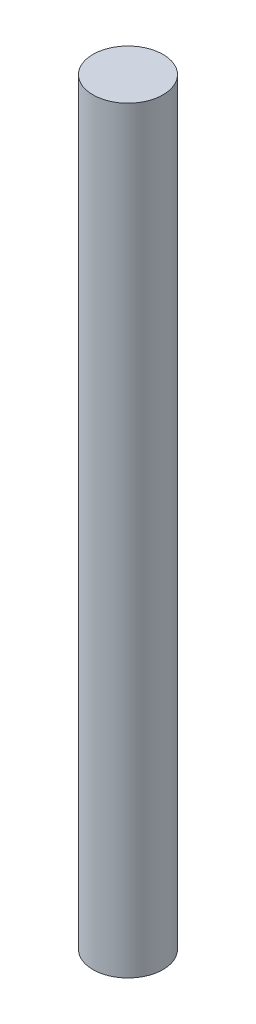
ISO-10303-21;
HEADER;
FILE_DESCRIPTION(('STEP AP214'),'2;1');
FILE_NAME('part.step','',(''),(''),'','','');
FILE_SCHEMA(('AUTOMOTIVE_DESIGN { 1 0 10303 214 1 1 1 1 }'));
ENDSEC;
DATA;
#1=APPLICATION_CONTEXT('core data for automotive mechanical design processes');
#2=APPLICATION_PROTOCOL_DEFINITION('international standard','automotive_design',2000,#1);
#3=PRODUCT_CONTEXT('',#1,'mechanical');
#4=PRODUCT('Part','Part','',(#3));
#5=PRODUCT_RELATED_PRODUCT_CATEGORY('part','',(#4));
#6=PRODUCT_DEFINITION_FORMATION('','',#4);
#7=PRODUCT_DEFINITION_CONTEXT('part definition',#1,'design');
#8=PRODUCT_DEFINITION('design','',#6,#7);
#9=PRODUCT_DEFINITION_SHAPE('','',#8);
#10=(LENGTH_UNIT() NAMED_UNIT(*) SI_UNIT(.MILLI.,.METRE.));
#11=(NAMED_UNIT(*) PLANE_ANGLE_UNIT() SI_UNIT($,.RADIAN.));
#12=(NAMED_UNIT(*) SI_UNIT($,.STERADIAN.) SOLID_ANGLE_UNIT());
#13=UNCERTAINTY_MEASURE_WITH_UNIT(LENGTH_MEASURE(1.E-05),#10,'distance_accuracy_value','');
#14=(GEOMETRIC_REPRESENTATION_CONTEXT(3) GLOBAL_UNCERTAINTY_ASSIGNED_CONTEXT((#13)) GLOBAL_UNIT_ASSIGNED_CONTEXT((#10,
#11,#12)) REPRESENTATION_CONTEXT('',''));
#15=CARTESIAN_POINT('',(0.,0.,0.));
#16=DIRECTION('',(0.,0.,1.));
#17=DIRECTION('',(1.,0.,0.));
#18=AXIS2_PLACEMENT_3D('',#15,#16,#17);
#19=CARTESIAN_POINT('',(0.,120.142,0.));
#20=DIRECTION('',(0.,-1.,0.));
#21=DIRECTION('',(0.,0.,-1.));
#22=AXIS2_PLACEMENT_3D('',#19,#20,#21);
#23=CYLINDRICAL_SURFACE('',#22,5.55625);
#24=CARTESIAN_POINT('',(0.,120.142,0.));
#25=DIRECTION('',(0.,1.,0.));
#26=DIRECTION('',(0.,0.,1.));
#27=AXIS2_PLACEMENT_3D('',#24,#25,#26);
#28=CIRCLE('',#27,5.55625);
#29=CARTESIAN_POINT('',(0.,120.142,5.55625));
#30=VERTEX_POINT('',#29);
#31=EDGE_CURVE('E10',#30,#30,#28,.T.);
#32=ORIENTED_EDGE('',*,*,#31,.F.);
#33=EDGE_LOOP('',(#32));
#34=FACE_BOUND('',#33,.T.);
#35=CARTESIAN_POINT('',(0.,0.,0.));
#36=DIRECTION('',(0.,1.,0.));
#37=DIRECTION('',(0.,0.,1.));
#38=AXIS2_PLACEMENT_3D('',#35,#36,#37);
#39=CIRCLE('',#38,5.55625);
#40=CARTESIAN_POINT('',(0.,0.,5.55625));
#41=VERTEX_POINT('',#40);
#42=EDGE_CURVE('E33',#41,#41,#39,.T.);
#43=ORIENTED_EDGE('',*,*,#42,.T.);
#44=EDGE_LOOP('',(#43));
#45=FACE_BOUND('',#44,.T.);
#46=ADVANCED_FACE('F30',(#34,#45),#23,.T.);
#47=CARTESIAN_POINT('',(0.,120.142,0.));
#48=DIRECTION('',(0.,1.,0.));
#49=DIRECTION('',(0.,0.,1.));
#50=AXIS2_PLACEMENT_3D('',#47,#48,#49);
#51=PLANE('',#50);
#52=ORIENTED_EDGE('',*,*,#31,.T.);
#53=EDGE_LOOP('',(#52));
#54=FACE_BOUND('',#53,.T.);
#55=ADVANCED_FACE('F45',(#54),#51,.T.);
#56=CARTESIAN_POINT('',(0.,0.,0.));
#57=DIRECTION('',(0.,1.,0.));
#58=DIRECTION('',(0.,0.,1.));
#59=AXIS2_PLACEMENT_3D('',#56,#57,#58);
#60=PLANE('',#59);
#61=ORIENTED_EDGE('',*,*,#42,.F.);
#62=EDGE_LOOP('',(#61));
#63=FACE_BOUND('',#62,.T.);
#64=ADVANCED_FACE('F43',(#63),#60,.F.);
#65=CLOSED_SHELL('',(#46,#55,#64));
#66=MANIFOLD_SOLID_BREP('B2',#65);
#67=ADVANCED_BREP_SHAPE_REPRESENTATION('',(#18,#66),#14);
#68=SHAPE_DEFINITION_REPRESENTATION(#9,#67);
ENDSEC;
END-ISO-10303-21;
